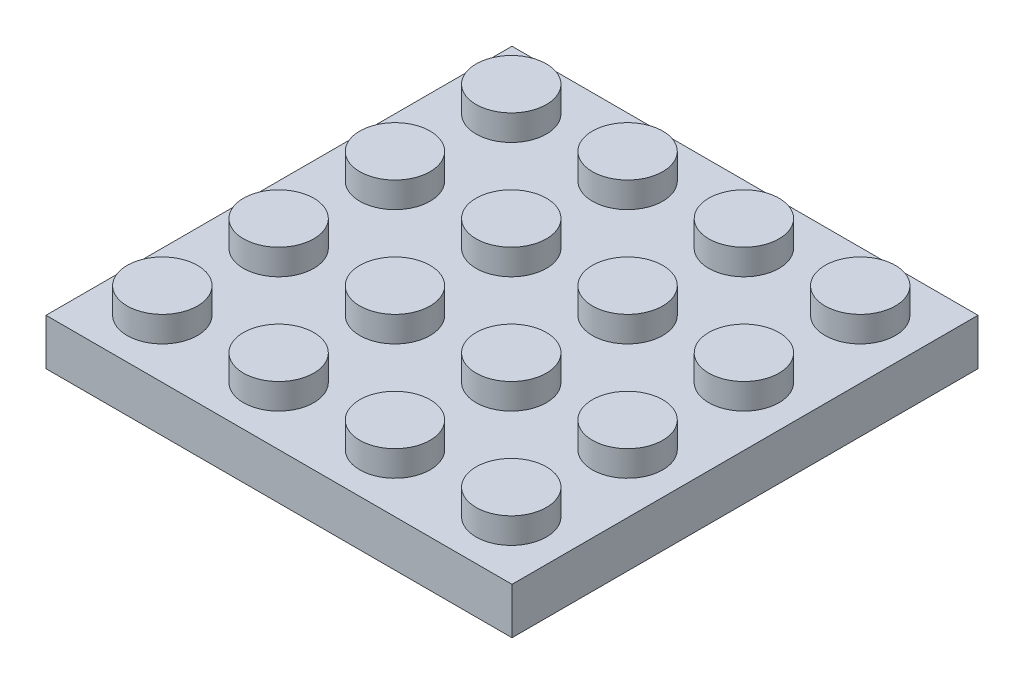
from build123d import *

# Parameters (mm, degrees)
SKETCH1_W      = 31.8
SKETCH1_H      = 31.8
EXTRUDE1_DEPTH = 3.16
SKETCH2_R      = 2.4
EXTRUDE2_DEPTH = 1.75
SHELL1_T       = -1.5875
SKETCH3_R      = 3.175
SKETCH3_R_2    = 2.38125
EXTRUDE3_DEPTH = 1.5725


with BuildPart() as part:
    # Sketch1 → Extrude1 (new body)
    with BuildSketch(Plane(origin=(0, 0, 0), x_dir=(1, 0, 0), z_dir=(0, 1, 0))):
        Rectangle(SKETCH1_W, SKETCH1_H)
    extrude(amount=EXTRUDE1_DEPTH)

    # Sketch2 → Extrude2 (add)
    with BuildSketch(Plane(origin=(0, 3.16, 0), x_dir=(1, 0, 0), z_dir=(0, 1, 0))):
        with Locations(Location((-11.93125, -11.93125, 0), (0, 0, 270))):
            Circle(SKETCH2_R)
        with Locations(Location((-3.99375, -11.93125, 0), (0, 0, 270))):
            Circle(SKETCH2_R)
        with Locations(Location((3.94375, -11.93125, 0), (0, 0, 270))):
            Circle(SKETCH2_R)
        with Locations(Location((11.88125, -11.93125, 0), (0, 0, 270))):
            Circle(SKETCH2_R)
        with Locations(Location((-11.93125, -3.99375, 0), (0, 0, 270))):
            Circle(SKETCH2_R)
        with Locations(Location((-3.99375, -3.99375, 0), (0, 0, 270))):
            Circle(SKETCH2_R)
        with Locations(Location((3.94375, -3.99375, 0), (0, 0, 270))):
            Circle(SKETCH2_R)
        with Locations(Location((11.88125, -3.99375, 0), (0, 0, 270))):
            Circle(SKETCH2_R)
        with Locations(Location((-11.93125, 3.94375, 0), (0, 0, 270))):
            Circle(SKETCH2_R)
        with Locations(Location((-3.99375, 3.94375, 0), (0, 0, 270))):
            Circle(SKETCH2_R)
        with Locations(Location((3.94375, 3.94375, 0), (0, 0, 270))):
            Circle(SKETCH2_R)
        with Locations(Location((11.88125, 3.94375, 0), (0, 0, 270))):
            Circle(SKETCH2_R)
        with Locations(Location((-11.93125, 11.88125, 0), (0, 0, 270))):
            Circle(SKETCH2_R)
        with Locations(Location((-3.99375, 11.88125, 0), (0, 0, 270))):
            Circle(SKETCH2_R)
        with Locations(Location((3.94375, 11.88125, 0), (0, 0, 270))):
            Circle(SKETCH2_R)
        with Locations(Location((11.88125, 11.88125, 0), (0, 0, 270))):
            Circle(SKETCH2_R)
    extrude(amount=EXTRUDE2_DEPTH)

    # Shell1
    shell1_openings = [part.faces().sort_by_distance(p)[0] for p in [
        (0, 0, 0),
    ]]
    offset(amount=SHELL1_T, openings=shell1_openings, kind=Kind.INTERSECTION)

    # Sketch3 → Extrude3 (add, through all)
    # profile 1 of 9: a face of its own
    with BuildSketch(Plane.XZ.offset(-1.5725)):
        with Locations(Location((-7.9625, 7.9625, 0), (0, 0, 90))):
            Circle(SKETCH3_R)
        with Locations(Location((-7.9625, 7.9625, 0), (0, 0, 270))):
            Circle(SKETCH3_R_2, mode=Mode.SUBTRACT)
    # profile 2 of 9: a face of its own
    with BuildSketch(Plane.XZ.offset(-1.5725)):
        with Locations(Location((-0.025, 7.9625, 0), (0, 0, 90))):
            Circle(SKETCH3_R)
        with Locations(Location((-0.025, 7.9625, 0), (0, 0, 270))):
            Circle(SKETCH3_R_2, mode=Mode.SUBTRACT)
    # profile 3 of 9: a face of its own
    with BuildSketch(Plane.XZ.offset(-1.5725)):
        with Locations(Location((7.9125, 7.9625, 0), (0, 0, 90))):
            Circle(SKETCH3_R)
        with Locations(Location((7.9125, 7.9625, 0), (0, 0, 270))):
            Circle(SKETCH3_R_2, mode=Mode.SUBTRACT)
    # profile 4 of 9: a face of its own
    with BuildSketch(Plane.XZ.offset(-1.5725)):
        with Locations(Location((-7.9625, 0.025, 0), (0, 0, 90))):
            Circle(SKETCH3_R)
        with Locations(Location((-7.9625, 0.025, 0), (0, 0, 270))):
            Circle(SKETCH3_R_2, mode=Mode.SUBTRACT)
    # profile 5 of 9: a face of its own
    with BuildSketch(Plane.XZ.offset(-1.5725)):
        with Locations(Location((-0.025, 0.025, 0), (0, 0, 90))):
            Circle(SKETCH3_R)
        with Locations(Location((-0.025, 0.025, 0), (0, 0, 270))):
            Circle(SKETCH3_R_2, mode=Mode.SUBTRACT)
    # profile 6 of 9: a face of its own
    with BuildSketch(Plane.XZ.offset(-1.5725)):
        with Locations(Location((7.9125, 0.025, 0), (0, 0, 90))):
            Circle(SKETCH3_R)
        with Locations(Location((7.9125, 0.025, 0), (0, 0, 270))):
            Circle(SKETCH3_R_2, mode=Mode.SUBTRACT)
    # profile 7 of 9: a face of its own
    with BuildSketch(Plane.XZ.offset(-1.5725)):
        with Locations(Location((-7.9625, -7.9125, 0), (0, 0, 90))):
            Circle(SKETCH3_R)
        with Locations(Location((-7.9625, -7.9125, 0), (0, 0, 270))):
            Circle(SKETCH3_R_2, mode=Mode.SUBTRACT)
    # profile 8 of 9: a face of its own
    with BuildSketch(Plane.XZ.offset(-1.5725)):
        with Locations(Location((-0.025, -7.9125, 0), (0, 0, 90))):
            Circle(SKETCH3_R)
        with Locations(Location((-0.025, -7.9125, 0), (0, 0, 270))):
            Circle(SKETCH3_R_2, mode=Mode.SUBTRACT)
    # profile 9 of 9: a face of its own
    with BuildSketch(Plane.XZ.offset(-1.5725)):
        with Locations(Location((7.9125, -7.9125, 0), (0, 0, 90))):
            Circle(SKETCH3_R)
        with Locations(Location((7.9125, -7.9125, 0), (0, 0, 270))):
            Circle(SKETCH3_R_2, mode=Mode.SUBTRACT)
    extrude(amount=EXTRUDE3_DEPTH)


solid = part.part
